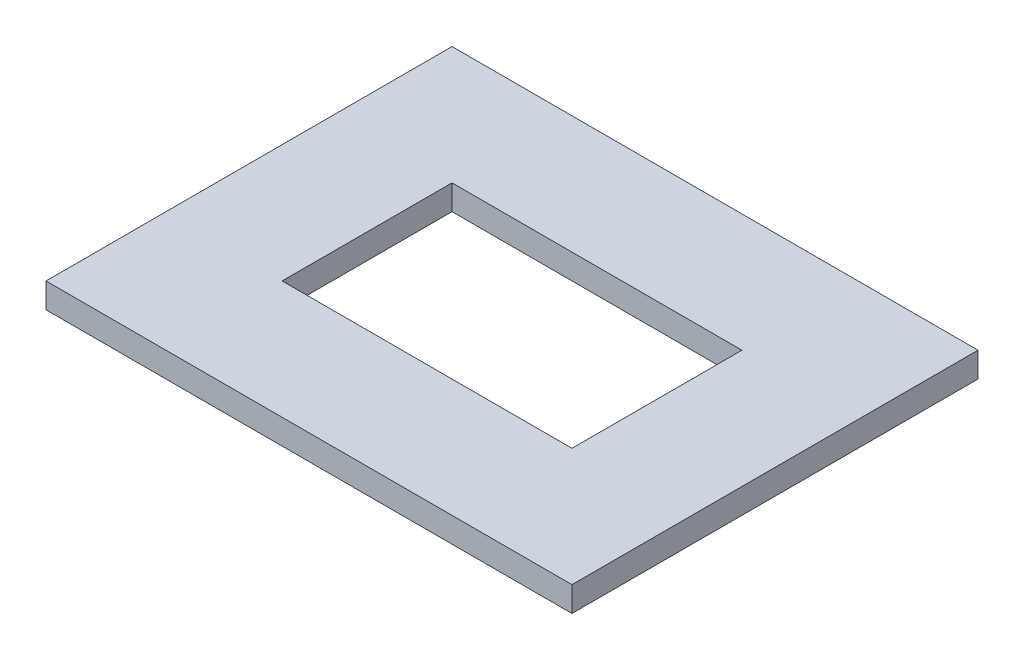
ISO-10303-21;
HEADER;
FILE_DESCRIPTION(('STEP AP214'),'2;1');
FILE_NAME('part.step','',(''),(''),'','','');
FILE_SCHEMA(('AUTOMOTIVE_DESIGN { 1 0 10303 214 1 1 1 1 }'));
ENDSEC;
DATA;
#1=APPLICATION_CONTEXT('core data for automotive mechanical design processes');
#2=APPLICATION_PROTOCOL_DEFINITION('international standard','automotive_design',2000,#1);
#3=PRODUCT_CONTEXT('',#1,'mechanical');
#4=PRODUCT('Part','Part','',(#3));
#5=PRODUCT_RELATED_PRODUCT_CATEGORY('part','',(#4));
#6=PRODUCT_DEFINITION_FORMATION('','',#4);
#7=PRODUCT_DEFINITION_CONTEXT('part definition',#1,'design');
#8=PRODUCT_DEFINITION('design','',#6,#7);
#9=PRODUCT_DEFINITION_SHAPE('','',#8);
#10=(LENGTH_UNIT() NAMED_UNIT(*) SI_UNIT(.MILLI.,.METRE.));
#11=(NAMED_UNIT(*) PLANE_ANGLE_UNIT() SI_UNIT($,.RADIAN.));
#12=(NAMED_UNIT(*) SI_UNIT($,.STERADIAN.) SOLID_ANGLE_UNIT());
#13=UNCERTAINTY_MEASURE_WITH_UNIT(LENGTH_MEASURE(1.E-05),#10,'distance_accuracy_value','');
#14=(GEOMETRIC_REPRESENTATION_CONTEXT(3) GLOBAL_UNCERTAINTY_ASSIGNED_CONTEXT((#13)) GLOBAL_UNIT_ASSIGNED_CONTEXT((#10,
#11,#12)) REPRESENTATION_CONTEXT('',''));
#15=CARTESIAN_POINT('',(0.,0.,0.));
#16=DIRECTION('',(0.,0.,1.));
#17=DIRECTION('',(1.,0.,0.));
#18=AXIS2_PLACEMENT_3D('',#15,#16,#17);
#19=CARTESIAN_POINT('',(0.,15.875,0.));
#20=DIRECTION('',(0.,1.,0.));
#21=DIRECTION('',(0.,0.,1.));
#22=AXIS2_PLACEMENT_3D('',#19,#20,#21);
#23=PLANE('',#22);
#24=DIRECTION('',(0.,0.,1.));
#25=VECTOR('',#24,1.);
#26=CARTESIAN_POINT('',(-167.075,15.875,128.975));
#27=LINE('',#26,#25);
#28=CARTESIAN_POINT('',(-167.075,15.875,-128.975));
#29=VERTEX_POINT('',#28);
#30=CARTESIAN_POINT('',(-167.075,15.875,128.975));
#31=VERTEX_POINT('',#30);
#32=EDGE_CURVE('E133',#29,#31,#27,.T.);
#33=ORIENTED_EDGE('',*,*,#32,.T.);
#34=DIRECTION('',(1.,0.,0.));
#35=VECTOR('',#34,1.);
#36=CARTESIAN_POINT('',(167.075,15.875,128.975));
#37=LINE('',#36,#35);
#38=CARTESIAN_POINT('',(167.075,15.875,128.975));
#39=VERTEX_POINT('',#38);
#40=EDGE_CURVE('E136',#31,#39,#37,.T.);
#41=ORIENTED_EDGE('',*,*,#40,.T.);
#42=DIRECTION('',(0.,0.,-1.));
#43=VECTOR('',#42,1.);
#44=CARTESIAN_POINT('',(167.075,15.875,128.975));
#45=LINE('',#44,#43);
#46=CARTESIAN_POINT('',(167.075,15.875,-128.975));
#47=VERTEX_POINT('',#46);
#48=EDGE_CURVE('E139',#39,#47,#45,.T.);
#49=ORIENTED_EDGE('',*,*,#48,.T.);
#50=DIRECTION('',(-1.,0.,0.));
#51=VECTOR('',#50,1.);
#52=CARTESIAN_POINT('',(167.075,15.875,-128.975));
#53=LINE('',#52,#51);
#54=EDGE_CURVE('E141',#47,#29,#53,.T.);
#55=ORIENTED_EDGE('',*,*,#54,.T.);
#56=EDGE_LOOP('',(#33,#41,#49,#55));
#57=FACE_BOUND('',#56,.T.);
#58=DIRECTION('',(1.,0.,0.));
#59=VECTOR('',#58,1.);
#60=CARTESIAN_POINT('',(92.075,15.875,53.975));
#61=LINE('',#60,#59);
#62=CARTESIAN_POINT('',(-92.075,15.875,53.975));
#63=VERTEX_POINT('',#62);
#64=CARTESIAN_POINT('',(92.075,15.875,53.975));
#65=VERTEX_POINT('',#64);
#66=EDGE_CURVE('E105',#63,#65,#61,.T.);
#67=ORIENTED_EDGE('',*,*,#66,.F.);
#68=DIRECTION('',(0.,0.,1.));
#69=VECTOR('',#68,1.);
#70=CARTESIAN_POINT('',(-92.075,15.875,53.975));
#71=LINE('',#70,#69);
#72=CARTESIAN_POINT('',(-92.075,15.875,-53.975));
#73=VERTEX_POINT('',#72);
#74=EDGE_CURVE('E97',#73,#63,#71,.T.);
#75=ORIENTED_EDGE('',*,*,#74,.F.);
#76=DIRECTION('',(-1.,0.,0.));
#77=VECTOR('',#76,1.);
#78=CARTESIAN_POINT('',(92.075,15.875,-53.975));
#79=LINE('',#78,#77);
#80=CARTESIAN_POINT('',(92.075,15.875,-53.975));
#81=VERTEX_POINT('',#80);
#82=EDGE_CURVE('E119',#81,#73,#79,.T.);
#83=ORIENTED_EDGE('',*,*,#82,.F.);
#84=DIRECTION('',(0.,0.,-1.));
#85=VECTOR('',#84,1.);
#86=CARTESIAN_POINT('',(92.075,15.875,53.975));
#87=LINE('',#86,#85);
#88=EDGE_CURVE('E117',#65,#81,#87,.T.);
#89=ORIENTED_EDGE('',*,*,#88,.F.);
#90=EDGE_LOOP('',(#67,#75,#83,#89));
#91=FACE_BOUND('',#90,.T.);
#92=ADVANCED_FACE('F32',(#57,#91),#23,.T.);
#93=CARTESIAN_POINT('',(0.,0.,0.));
#94=DIRECTION('',(0.,1.,0.));
#95=DIRECTION('',(0.,0.,1.));
#96=AXIS2_PLACEMENT_3D('',#93,#94,#95);
#97=PLANE('',#96);
#98=DIRECTION('',(0.,0.,1.));
#99=VECTOR('',#98,1.);
#100=CARTESIAN_POINT('',(-167.075,0.,128.975));
#101=LINE('',#100,#99);
#102=CARTESIAN_POINT('',(-167.075,0.,-128.975));
#103=VERTEX_POINT('',#102);
#104=CARTESIAN_POINT('',(-167.075,0.,128.975));
#105=VERTEX_POINT('',#104);
#106=EDGE_CURVE('E113',#103,#105,#101,.T.);
#107=ORIENTED_EDGE('',*,*,#106,.F.);
#108=DIRECTION('',(-1.,0.,0.));
#109=VECTOR('',#108,1.);
#110=CARTESIAN_POINT('',(167.075,0.,-128.975));
#111=LINE('',#110,#109);
#112=CARTESIAN_POINT('',(167.075,0.,-128.975));
#113=VERTEX_POINT('',#112);
#114=EDGE_CURVE('E137',#113,#103,#111,.T.);
#115=ORIENTED_EDGE('',*,*,#114,.F.);
#116=DIRECTION('',(0.,0.,-1.));
#117=VECTOR('',#116,1.);
#118=CARTESIAN_POINT('',(167.075,0.,128.975));
#119=LINE('',#118,#117);
#120=CARTESIAN_POINT('',(167.075,0.,128.975));
#121=VERTEX_POINT('',#120);
#122=EDGE_CURVE('E148',#121,#113,#119,.T.);
#123=ORIENTED_EDGE('',*,*,#122,.F.);
#124=DIRECTION('',(1.,0.,0.));
#125=VECTOR('',#124,1.);
#126=CARTESIAN_POINT('',(167.075,0.,128.975));
#127=LINE('',#126,#125);
#128=EDGE_CURVE('E146',#105,#121,#127,.T.);
#129=ORIENTED_EDGE('',*,*,#128,.F.);
#130=EDGE_LOOP('',(#107,#115,#123,#129));
#131=FACE_BOUND('',#130,.T.);
#132=DIRECTION('',(0.,0.,1.));
#133=VECTOR('',#132,1.);
#134=CARTESIAN_POINT('',(-92.075,0.,53.975));
#135=LINE('',#134,#133);
#136=CARTESIAN_POINT('',(-92.075,0.,-53.975));
#137=VERTEX_POINT('',#136);
#138=CARTESIAN_POINT('',(-92.075,0.,53.975));
#139=VERTEX_POINT('',#138);
#140=EDGE_CURVE('E55',#137,#139,#135,.T.);
#141=ORIENTED_EDGE('',*,*,#140,.T.);
#142=DIRECTION('',(1.,0.,0.));
#143=VECTOR('',#142,1.);
#144=CARTESIAN_POINT('',(92.075,0.,53.975));
#145=LINE('',#144,#143);
#146=CARTESIAN_POINT('',(92.075,0.,53.975));
#147=VERTEX_POINT('',#146);
#148=EDGE_CURVE('E112',#139,#147,#145,.T.);
#149=ORIENTED_EDGE('',*,*,#148,.T.);
#150=DIRECTION('',(0.,0.,-1.));
#151=VECTOR('',#150,1.);
#152=CARTESIAN_POINT('',(92.075,0.,53.975));
#153=LINE('',#152,#151);
#154=CARTESIAN_POINT('',(92.075,0.,-53.975));
#155=VERTEX_POINT('',#154);
#156=EDGE_CURVE('E125',#147,#155,#153,.T.);
#157=ORIENTED_EDGE('',*,*,#156,.T.);
#158=DIRECTION('',(-1.,0.,0.));
#159=VECTOR('',#158,1.);
#160=CARTESIAN_POINT('',(92.075,0.,-53.975));
#161=LINE('',#160,#159);
#162=EDGE_CURVE('E106',#155,#137,#161,.T.);
#163=ORIENTED_EDGE('',*,*,#162,.T.);
#164=EDGE_LOOP('',(#141,#149,#157,#163));
#165=FACE_BOUND('',#164,.T.);
#166=ADVANCED_FACE('F166',(#131,#165),#97,.F.);
#167=CARTESIAN_POINT('',(-167.075,15.875,128.975));
#168=DIRECTION('',(1.,0.,0.));
#169=DIRECTION('',(0.,0.,-1.));
#170=AXIS2_PLACEMENT_3D('',#167,#168,#169);
#171=PLANE('',#170);
#172=ORIENTED_EDGE('',*,*,#106,.T.);
#173=DIRECTION('',(0.,-1.,0.));
#174=VECTOR('',#173,1.);
#175=CARTESIAN_POINT('',(-167.075,15.875,128.975));
#176=LINE('',#175,#174);
#177=EDGE_CURVE('E11',#31,#105,#176,.T.);
#178=ORIENTED_EDGE('',*,*,#177,.F.);
#179=ORIENTED_EDGE('',*,*,#32,.F.);
#180=DIRECTION('',(0.,-1.,0.));
#181=VECTOR('',#180,1.);
#182=CARTESIAN_POINT('',(-167.075,15.875,-128.975));
#183=LINE('',#182,#181);
#184=EDGE_CURVE('E143',#29,#103,#183,.T.);
#185=ORIENTED_EDGE('',*,*,#184,.T.);
#186=EDGE_LOOP('',(#172,#178,#179,#185));
#187=FACE_BOUND('',#186,.T.);
#188=ADVANCED_FACE('F34',(#187),#171,.F.);
#189=CARTESIAN_POINT('',(167.075,15.875,128.975));
#190=DIRECTION('',(0.,0.,-1.));
#191=DIRECTION('',(-1.,0.,0.));
#192=AXIS2_PLACEMENT_3D('',#189,#190,#191);
#193=PLANE('',#192);
#194=ORIENTED_EDGE('',*,*,#128,.T.);
#195=DIRECTION('',(0.,-1.,0.));
#196=VECTOR('',#195,1.);
#197=CARTESIAN_POINT('',(167.075,15.875,128.975));
#198=LINE('',#197,#196);
#199=EDGE_CURVE('E40',#39,#121,#198,.T.);
#200=ORIENTED_EDGE('',*,*,#199,.F.);
#201=ORIENTED_EDGE('',*,*,#40,.F.);
#202=ORIENTED_EDGE('',*,*,#177,.T.);
#203=EDGE_LOOP('',(#194,#200,#201,#202));
#204=FACE_BOUND('',#203,.T.);
#205=ADVANCED_FACE('F176',(#204),#193,.F.);
#206=CARTESIAN_POINT('',(167.075,15.875,128.975));
#207=DIRECTION('',(-1.,0.,0.));
#208=DIRECTION('',(0.,0.,1.));
#209=AXIS2_PLACEMENT_3D('',#206,#207,#208);
#210=PLANE('',#209);
#211=ORIENTED_EDGE('',*,*,#122,.T.);
#212=DIRECTION('',(0.,-1.,0.));
#213=VECTOR('',#212,1.);
#214=CARTESIAN_POINT('',(167.075,15.875,-128.975));
#215=LINE('',#214,#213);
#216=EDGE_CURVE('E153',#47,#113,#215,.T.);
#217=ORIENTED_EDGE('',*,*,#216,.F.);
#218=ORIENTED_EDGE('',*,*,#48,.F.);
#219=ORIENTED_EDGE('',*,*,#199,.T.);
#220=EDGE_LOOP('',(#211,#217,#218,#219));
#221=FACE_BOUND('',#220,.T.);
#222=ADVANCED_FACE('F160',(#221),#210,.F.);
#223=CARTESIAN_POINT('',(167.075,15.875,-128.975));
#224=DIRECTION('',(0.,0.,1.));
#225=DIRECTION('',(1.,0.,0.));
#226=AXIS2_PLACEMENT_3D('',#223,#224,#225);
#227=PLANE('',#226);
#228=ORIENTED_EDGE('',*,*,#114,.T.);
#229=ORIENTED_EDGE('',*,*,#184,.F.);
#230=ORIENTED_EDGE('',*,*,#54,.F.);
#231=ORIENTED_EDGE('',*,*,#216,.T.);
#232=EDGE_LOOP('',(#228,#229,#230,#231));
#233=FACE_BOUND('',#232,.T.);
#234=ADVANCED_FACE('F170',(#233),#227,.F.);
#235=CARTESIAN_POINT('',(-92.075,15.875,53.975));
#236=DIRECTION('',(1.,0.,0.));
#237=DIRECTION('',(0.,0.,-1.));
#238=AXIS2_PLACEMENT_3D('',#235,#236,#237);
#239=PLANE('',#238);
#240=ORIENTED_EDGE('',*,*,#140,.F.);
#241=DIRECTION('',(0.,-1.,0.));
#242=VECTOR('',#241,1.);
#243=CARTESIAN_POINT('',(-92.075,15.875,-53.975));
#244=LINE('',#243,#242);
#245=EDGE_CURVE('E101',#73,#137,#244,.T.);
#246=ORIENTED_EDGE('',*,*,#245,.F.);
#247=ORIENTED_EDGE('',*,*,#74,.T.);
#248=DIRECTION('',(0.,-1.,0.));
#249=VECTOR('',#248,1.);
#250=CARTESIAN_POINT('',(-92.075,15.875,53.975));
#251=LINE('',#250,#249);
#252=EDGE_CURVE('E100',#63,#139,#251,.T.);
#253=ORIENTED_EDGE('',*,*,#252,.T.);
#254=EDGE_LOOP('',(#240,#246,#247,#253));
#255=FACE_BOUND('',#254,.T.);
#256=ADVANCED_FACE('F99',(#255),#239,.T.);
#257=CARTESIAN_POINT('',(92.075,15.875,53.975));
#258=DIRECTION('',(0.,0.,-1.));
#259=DIRECTION('',(-1.,0.,0.));
#260=AXIS2_PLACEMENT_3D('',#257,#258,#259);
#261=PLANE('',#260);
#262=ORIENTED_EDGE('',*,*,#148,.F.);
#263=ORIENTED_EDGE('',*,*,#252,.F.);
#264=ORIENTED_EDGE('',*,*,#66,.T.);
#265=DIRECTION('',(0.,-1.,0.));
#266=VECTOR('',#265,1.);
#267=CARTESIAN_POINT('',(92.075,15.875,53.975));
#268=LINE('',#267,#266);
#269=EDGE_CURVE('E114',#65,#147,#268,.T.);
#270=ORIENTED_EDGE('',*,*,#269,.T.);
#271=EDGE_LOOP('',(#262,#263,#264,#270));
#272=FACE_BOUND('',#271,.T.);
#273=ADVANCED_FACE('F109',(#272),#261,.T.);
#274=CARTESIAN_POINT('',(92.075,15.875,53.975));
#275=DIRECTION('',(-1.,0.,0.));
#276=DIRECTION('',(0.,0.,1.));
#277=AXIS2_PLACEMENT_3D('',#274,#275,#276);
#278=PLANE('',#277);
#279=ORIENTED_EDGE('',*,*,#156,.F.);
#280=ORIENTED_EDGE('',*,*,#269,.F.);
#281=ORIENTED_EDGE('',*,*,#88,.T.);
#282=DIRECTION('',(0.,-1.,0.));
#283=VECTOR('',#282,1.);
#284=CARTESIAN_POINT('',(92.075,15.875,-53.975));
#285=LINE('',#284,#283);
#286=EDGE_CURVE('E47',#81,#155,#285,.T.);
#287=ORIENTED_EDGE('',*,*,#286,.T.);
#288=EDGE_LOOP('',(#279,#280,#281,#287));
#289=FACE_BOUND('',#288,.T.);
#290=ADVANCED_FACE('F199',(#289),#278,.T.);
#291=CARTESIAN_POINT('',(92.075,15.875,-53.975));
#292=DIRECTION('',(0.,0.,1.));
#293=DIRECTION('',(1.,0.,0.));
#294=AXIS2_PLACEMENT_3D('',#291,#292,#293);
#295=PLANE('',#294);
#296=ORIENTED_EDGE('',*,*,#162,.F.);
#297=ORIENTED_EDGE('',*,*,#286,.F.);
#298=ORIENTED_EDGE('',*,*,#82,.T.);
#299=ORIENTED_EDGE('',*,*,#245,.T.);
#300=EDGE_LOOP('',(#296,#297,#298,#299));
#301=FACE_BOUND('',#300,.T.);
#302=ADVANCED_FACE('F203',(#301),#295,.T.);
#303=CLOSED_SHELL('',(#92,#166,#188,#205,#222,#234,#256,#273,#290,#302));
#304=MANIFOLD_SOLID_BREP('B2',#303);
#305=ADVANCED_BREP_SHAPE_REPRESENTATION('',(#18,#304),#14);
#306=SHAPE_DEFINITION_REPRESENTATION(#9,#305);
ENDSEC;
END-ISO-10303-21;
